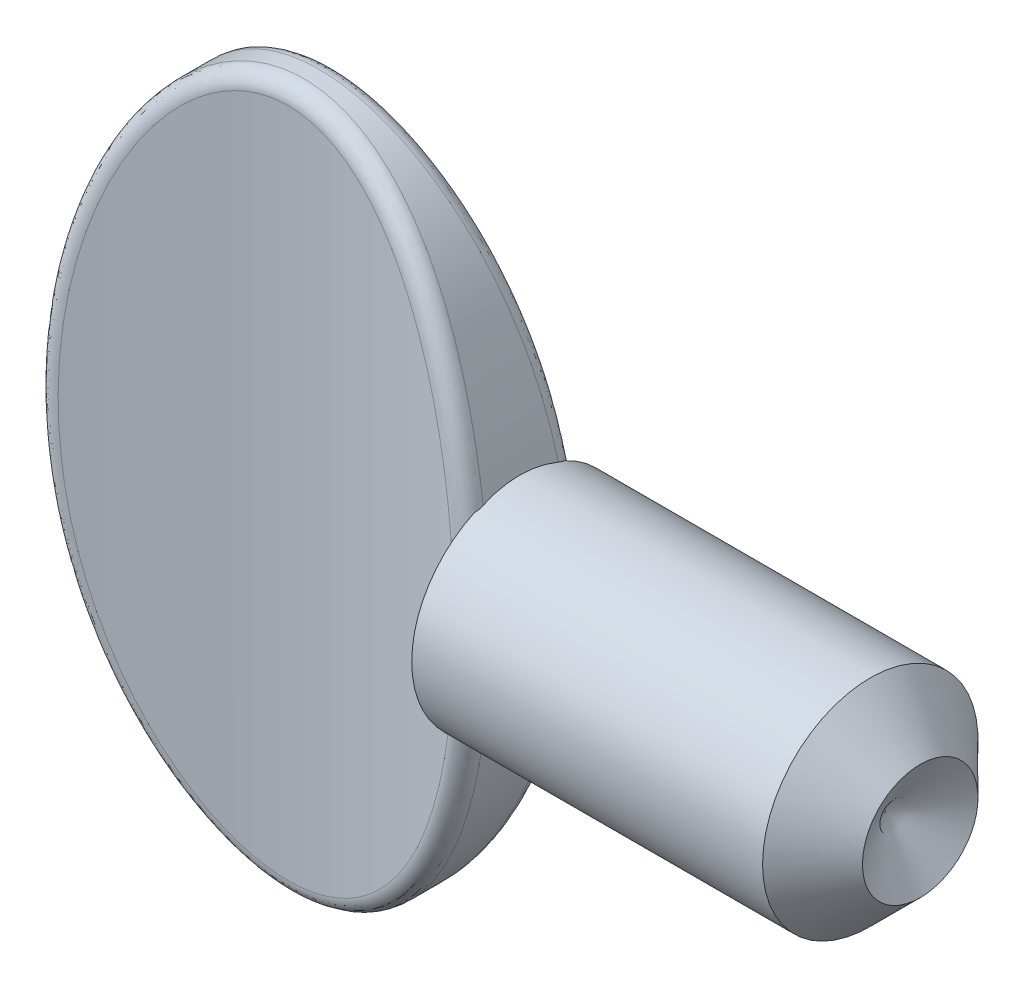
from build123d import *

# Parameters (mm, degrees)
SKETCH1_RX              = 5.715
SKETCH1_RY              = 3.556
EXTRUDE1_DEPTH          = 1.016
CUT_EXTRUDE1_DEPTH      = 7.8072473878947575
CUT_EXTRUDE1_DEPTH_BACK = 7.8072473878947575
SKETCH2_OUTSIDE_W       = 11.834000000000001
SKETCH2_OUTSIDE_H       = 6.754
FILLET3_R               = 0.254


with BuildPart() as part:
    # Sketch1 → Extrude1 (new, symmetric)
    with BuildSketch(Plane.XY):
        with Locations(Location((0, 0), (0, 0, -90))):
            Ellipse(SKETCH1_RX, SKETCH1_RY)
    extrude(amount=EXTRUDE1_DEPTH, both=True)

    # Sketch2 outside → Cut-Extrude1 (cut, two sides: drawn at the far end of the back side and taken through both)
    with BuildSketch(Plane(origin=(0, 0, 0), x_dir=(1, 0, 0), z_dir=(0, 1, 0)).offset(-CUT_EXTRUDE1_DEPTH_BACK)):
        Rectangle(SKETCH2_OUTSIDE_W, SKETCH2_OUTSIDE_H)
        with BuildLine():
            Line((-3.556, 1.016), (-3.556, -1.016))
            ThreePointArc((-3.556, -1.016), (6.3e-16, -0.3810000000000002), (3.556, -1.016))
            Line((3.556, -1.016), (3.556, 1.016))
            ThreePointArc((3.556, 1.016), (6.3e-16, 0.3810000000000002), (-3.556, 1.016))
        make_face(mode=Mode.SUBTRACT)
    extrude(amount=CUT_EXTRUDE1_DEPTH + CUT_EXTRUDE1_DEPTH_BACK, mode=Mode.SUBTRACT)

    # Fillet3
    fillet3_edges = [part.edges().sort_by_distance(p)[0] for p in [
        (-2.772297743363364, -3.579097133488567, 0.7620899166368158),
        (6.761380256e-08, 5.714999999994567, -0.38099999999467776),
    ]]
    fillet(fillet3_edges, radius=FILLET3_R)

    # Sketch3 → Revolve1 (revolve)
    with BuildSketch(Plane(origin=(0, 0, 0), x_dir=(1, 0, 0), z_dir=(0, 1, 0)), mode=Mode.PRIVATE) as revolve1_sk:
        with BuildLine():
            Line((9.093200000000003, 1.7526), (9.906, 0.9398))
            Line((9.906, 0.9398), (9.341311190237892, -1.1e-16))
            Line((9.341311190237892, -1.1e-16), (2.577464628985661, 1e-17))
            Line((2.577464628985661, 1e-17), (2.577464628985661, 0.7095513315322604))
            ThreePointArc((2.577464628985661, 0.7095513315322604), (3.1592934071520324, 1.093146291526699), (3.3846611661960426, 1.7526000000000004))
            Line((3.3846611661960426, 1.7526000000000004), (4.741333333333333, 1.7526))
            Line((4.741333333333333, 1.7526), (9.093200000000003, 1.7526))
        make_face()
    revolve(revolve1_sk.sketch.rotate(Axis((0, 0, 0), (1, 0, 0)), 180), axis=Axis((0, 0, 0), (1, 0, 0)))


solid = part.part
